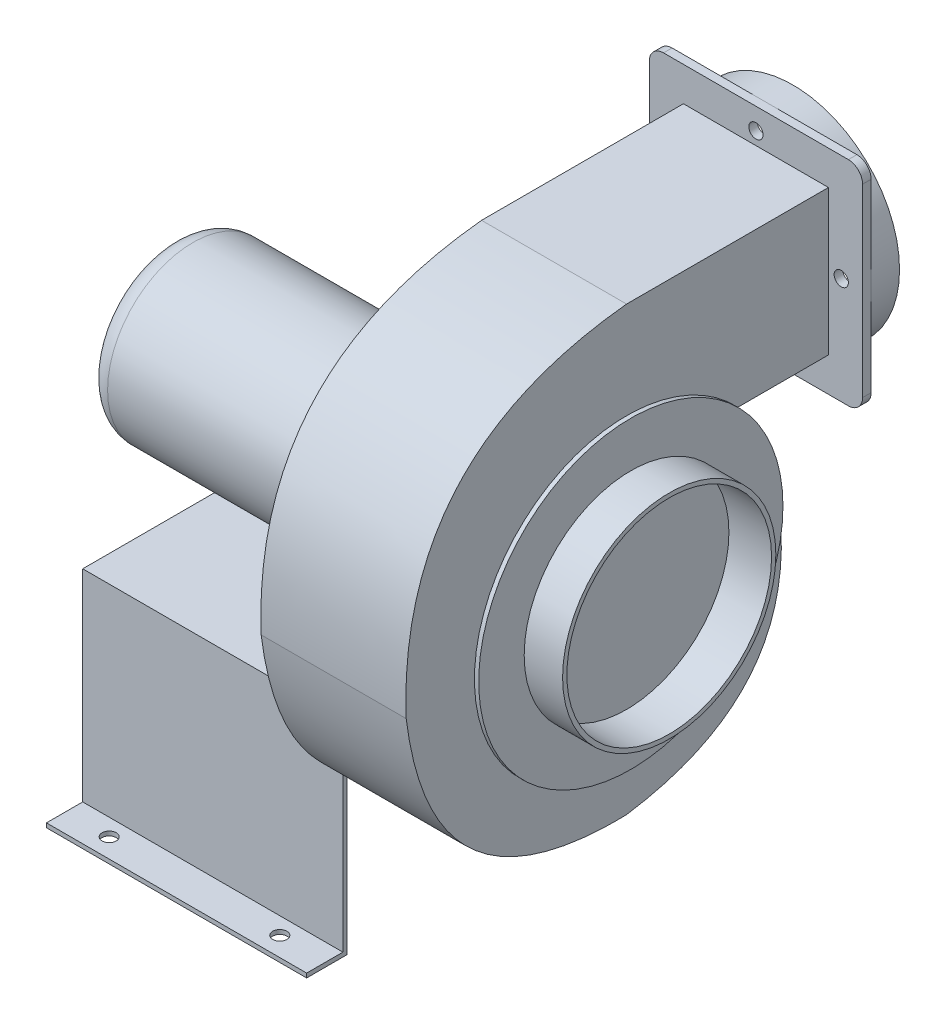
from build123d import *

# Parameters (mm, degrees)
EXTRUDE_1_DEPTH     = 102
EXTRUDE_2_DEPTH     = 6
SKETCH_3_R          = 75
SKETCH_3_R_2        = 72
EXTRUDE_3_DEPTH     = 20
SKETCH_4_W          = 100
SKETCH_4_H          = 100
CUT_EXTRUDE_1_DEPTH = 130
SKETCH_5_R          = 5
CUT_EXTRUDE_2_DEPTH = 6
SKETCH_6_R          = 107
SKETCH_6_R_2        = 75
EXTRUDE_4_DEPTH     = 3
SKETCH_7_R          = 75
SKETCH_7_R_2        = 72
EXTRUDE_5_DEPTH     = 30
SKETCH_8_R          = 60
EXTRUDE_6_DEPTH     = 218
FILLET_1_R          = 15
EXTRUDE_7_DEPTH     = 183
SKETCH_11_R         = 5
CUT_EXTRUDE_3_DEPTH = 3


with BuildPart() as part:
    # Sketch 1 → Extrude 1 (new body)
    with BuildSketch(Plane(origin=(0, 0, 0), x_dir=(0, 0, -1), z_dir=(1, 0, 0))):
        with BuildLine():
            Line((0, 175), (142, 175))
            Line((142, 175), (142, 73))
            Line((142, 73), (78.230428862, 73))
            ThreePointArc((78.230428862, 73), (99.548118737, 39.232283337), (107, 0))
            add(Edge.make_bspline(
                [(107, 0), (123.163257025, -117.699949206), (0, -136)],
                knots=[0, 0, 0, 1, 1, 1], degree=2))
            add(Edge.make_bspline(
                [(-155, 0), (-137.39016304, -139.427360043), (0, -136)],
                knots=[0, 0, 0, 1, 1, 1], degree=2))
            add(Edge.make_bspline(
                [(0, 175), (-161.023794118, 158.268866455), (-155, 0)],
                knots=[0, 0, 0, 1, 1, 1], degree=2))
        make_face()
    extrude(amount=EXTRUDE_1_DEPTH)

    # Sketch 2 → Extrude 2 (add)
    with BuildSketch(Plane(origin=(0, 0, -142), x_dir=(-1, 0, 0), z_dir=(0, 0, -1))):
        with BuildLine():
            Line((-116, 49), (14, 49))
            ThreePointArc((14, 49), (21.071067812, 51.928932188), (24, 59))
            Line((24, 59), (24, 189))
            ThreePointArc((24, 189), (21.071067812, 196.071067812), (14, 199))
            Line((14, 199), (-116, 199))
            ThreePointArc((-116, 199), (-123.071067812, 196.071067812), (-126, 189))
            Line((-126, 189), (-126, 59))
            ThreePointArc((-126, 59), (-123.071067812, 51.928932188), (-116, 49))
        make_face()
    extrude(amount=EXTRUDE_2_DEPTH)

    # Sketch 3 → Extrude 3 (add)
    with BuildSketch(Plane(origin=(0, 0, -148), x_dir=(-1, 0, 0), z_dir=(0, 0, -1))):
        with Locations((-51, 124)):
            Circle(SKETCH_3_R)
        with Locations((-51, 124)):
            Circle(SKETCH_3_R_2, mode=Mode.SUBTRACT)
    extrude(amount=EXTRUDE_3_DEPTH)

    # Sketch 4 → Cut-Extrude 1 (cut)
    with BuildSketch(Plane(origin=(0, 0, -148), x_dir=(-1, 0, 0), z_dir=(0, 0, -1))):
        with Locations((-51, 124)):
            Rectangle(SKETCH_4_W, SKETCH_4_H)
    extrude(amount=-CUT_EXTRUDE_1_DEPTH, mode=Mode.SUBTRACT)

    # Sketch 5 → Cut-Extrude 2 (cut)
    with BuildSketch(Plane(origin=(0, 0, -148), x_dir=(-1, 0, 0), z_dir=(0, 0, -1))):
        with Locations((-51, 184)):
            Circle(SKETCH_5_R)
        with Locations((-111, 124)):
            Circle(SKETCH_5_R)
        with Locations((9, 124)):
            Circle(SKETCH_5_R)
        with Locations((-51, 64)):
            Circle(SKETCH_5_R)
    extrude(amount=-CUT_EXTRUDE_2_DEPTH, mode=Mode.SUBTRACT)

    # Sketch 6 → Extrude 4 (add)
    with BuildSketch(Plane(origin=(102, 0, 0), x_dir=(0, 0, -1), z_dir=(1, 0, 0))):
        Circle(SKETCH_6_R)
        Circle(SKETCH_6_R_2, mode=Mode.SUBTRACT)
    extrude(amount=EXTRUDE_4_DEPTH)

    # Sketch 7 → Extrude 5 (add)
    with BuildSketch(Plane(origin=(102, 0, 0), x_dir=(0, 0, -1), z_dir=(1, 0, 0))):
        Circle(SKETCH_7_R)
        Circle(SKETCH_7_R_2, mode=Mode.SUBTRACT)
    extrude(amount=EXTRUDE_5_DEPTH)

    # Sketch 10 → Extrude 7 (add)
    with BuildSketch(Plane.ZY):
        Polygon((-97.5, -80), (-97.5, -222), (-123, -222), (-123, -225), (-94.5, -225), (-94.5, -83), (94.5, -83), (94.5, -225), (123, -225), (123, -222), (97.5, -222), (97.5, -80), align=None)
    extrude(amount=EXTRUDE_7_DEPTH)

    # Sketch 11 → Cut-Extrude 3 (cut)
    with BuildSketch(Plane.XZ.offset(225)):
        with Locations(Location((-152.428518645, 109.464128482, 0), (0, 0, 270))):
            Circle(SKETCH_11_R)
        with Locations(Location((-32.428518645, 109.464128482, 0), (0, 0, 270))):
            Circle(SKETCH_11_R)
        with Locations(Location((-32.428518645, -112.535871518, 0), (0, 0, 270))):
            Circle(SKETCH_11_R)
        with Locations(Location((-152.428518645, -112.535871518, 0), (0, 0, 270))):
            Circle(SKETCH_11_R)
    extrude(amount=-CUT_EXTRUDE_3_DEPTH, mode=Mode.SUBTRACT)


with BuildPart() as body_2:
    # Sketch 8 → Extrude 6 (new body)
    with BuildSketch(Plane.ZY):
        Circle(SKETCH_8_R)
    extrude(amount=EXTRUDE_6_DEPTH)

    # Fillet 1
    fillet_1_edges = [body_2.edges().sort_by_distance(p)[0] for p in [
        (-218, 0, -60),
    ]]
    fillet(fillet_1_edges, radius=FILLET_1_R)


solid = Compound([part.part, body_2.part])
